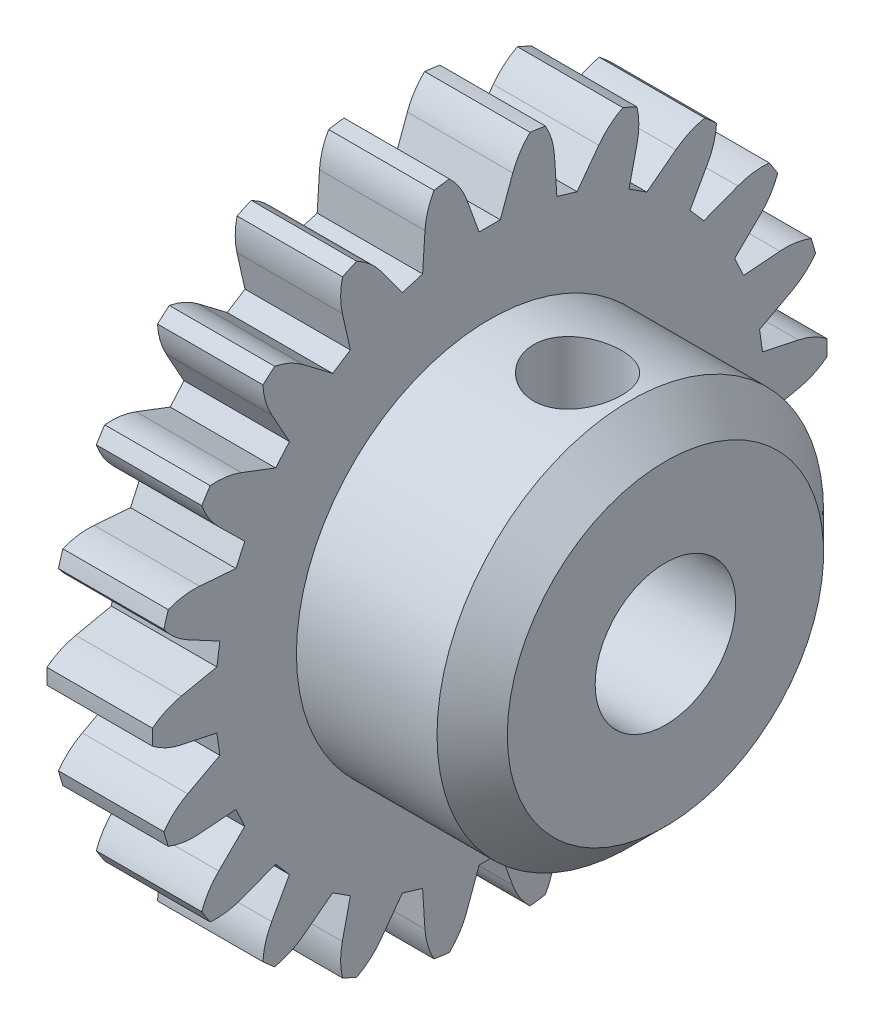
from build123d import *

# Parameters (mm, degrees)
ENL_V_MAT_EXTRU_1_DEPTH      = 16.758172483
R_P_TITION_CIRCULAIRE1_COUNT = 22
CHANFREIN1_SIZE              = 1
ESQUISSE3_R                  = 1.25
ENL_V_MAT_EXTRU_2_DEPTH      = 20


with BuildPart() as part:
    # Esquisse1 → R_volution1 (revolve)
    with BuildSketch(Plane.XY, mode=Mode.PRIVATE) as r_volution1_sk:
        Polygon((0, 2), (8, 2), (8, 5.5), (3, 5.5), (3, 9.6), (0, 9.6), align=None)
    revolve(r_volution1_sk.sketch.rotate(Axis((-19.448313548, 0, 0), (1, 0, 0)), 90), axis=Axis((-19.448313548, 0, 0), (1, 0, 0)))

    # Esquisse2 → Enl_v. mat.-Extru.1 (cut, through all)
    with BuildSketch(Plane.ZY):
        with BuildLine():
            Line((-1.465062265, 9.781034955), (1.507494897, 9.80773814))
            ThreePointArc((1.507494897, 9.80773814), (0.992370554, 9.365094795), (0.655083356, 8.775583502))
            Line((0.655083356, 8.775583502), (0.3, 7.8))
            Line((0.3, 7.8), (-0.300853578, 7.8))
            Line((-0.300853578, 7.8), (-0.655914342, 8.77552143))
            ThreePointArc((-0.655914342, 8.77552143), (-0.977149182, 9.345342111), (-1.465062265, 9.781034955))
        make_face()
    enl_v_mat_extru_1 = extrude(amount=-ENL_V_MAT_EXTRU_1_DEPTH, mode=Mode.SUBTRACT)

    # R_p_tition circulaire1: Enl_v. mat.-Extru.1 ×22 about axis
    r_p_tition_circulaire1_axis = Axis((0, 0, 0), (1, 0, 0))
    for i in range(1, R_P_TITION_CIRCULAIRE1_COUNT):
        add(enl_v_mat_extru_1.rotate(r_p_tition_circulaire1_axis, i * 360 / R_P_TITION_CIRCULAIRE1_COUNT), mode=Mode.SUBTRACT)

    # Chanfrein1
    chanfrein1_edges = [part.edges().sort_by_distance(p)[0] for p in [
        (8, 0, -5.5),
    ]]
    chamfer(chanfrein1_edges, length=CHANFREIN1_SIZE)

    # Esquisse3 → Enl_v. mat.-Extru.2 (cut)
    with BuildSketch(Plane(origin=(0, 0, 0), x_dir=(1, 0, 0), z_dir=(0, 1, 0))):
        with Locations(Location((5.5, 0, 0), (0, 0, 90))):
            Circle(ESQUISSE3_R)
    extrude(amount=ENL_V_MAT_EXTRU_2_DEPTH, mode=Mode.SUBTRACT)


solid = part.part
